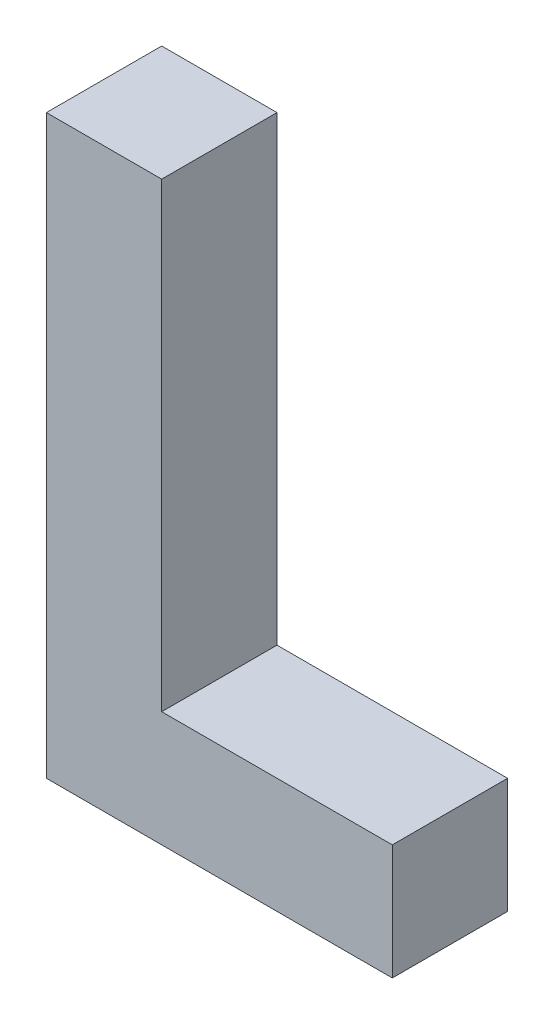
from build123d import *

# Parameters (mm, degrees)
BOSS_EXTRU_1_DEPTH = 10


with BuildPart() as part:
    # Esquisse1 → Boss.-Extru.1 (new body)
    with BuildSketch(Plane.XY):
        Polygon((0, 0), (30, 0), (30, 10), (10, 10), (10, 50), (0, 50), (0, 10), align=None)
    extrude(amount=BOSS_EXTRU_1_DEPTH)


solid = part.part
